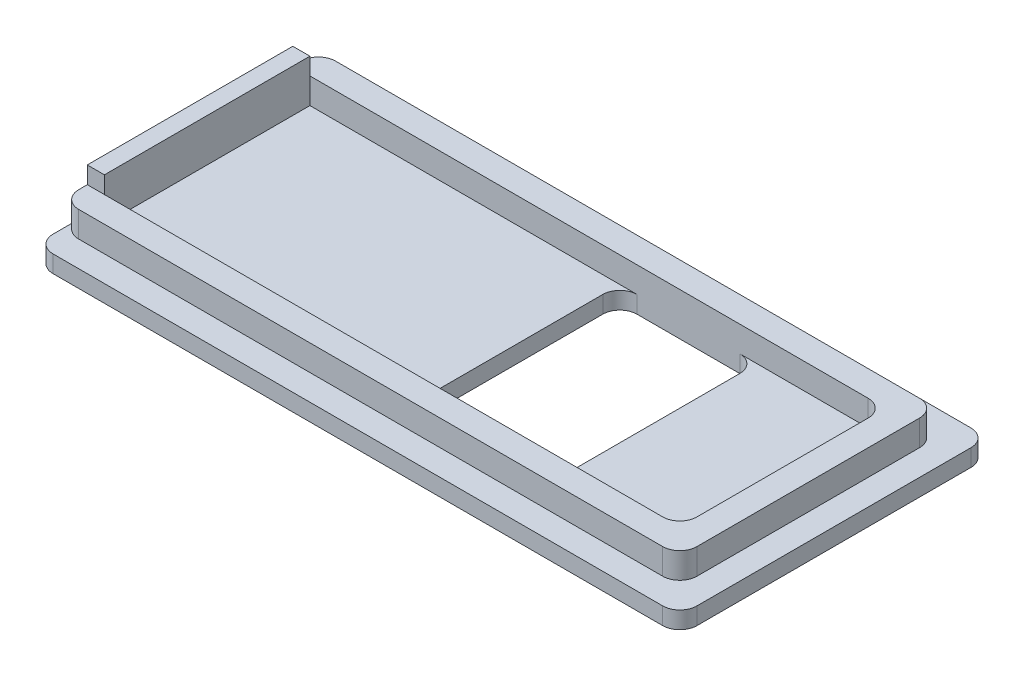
from build123d import *

# Parameters (mm, degrees)
CROQUIS1_W              = 37.6
CROQUIS1_H              = 18
SALIENTE_EXTRUIR1_DEPTH = 1
SALIENTE_EXTRUIR3_DEPTH = 1.5
CROQUIS4_W              = 1
CROQUIS4_H              = 12
SALIENTE_EXTRUIR4_DEPTH = 2.5
CROQUIS5_W              = 8
CROQUIS5_H              = 12
CORTAR_EXTRUIR1_DEPTH   = 42.761345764
REDONDEO9_R             = 1
REDONDEO10_R            = 1
REDONDEO11_R            = 1


with BuildPart() as part:
    # Croquis1 → Saliente-Extruir1 (new body)
    with BuildSketch(Plane(origin=(0, 0, 0), x_dir=(1, 0, 0), z_dir=(0, 1, 0))):
        with Locations((18.8, 9)):
            Rectangle(CROQUIS1_W, CROQUIS1_H)
    extrude(amount=SALIENTE_EXTRUIR1_DEPTH)

    # Croquis3 → Saliente-Extruir3 (add)
    with BuildSketch(Plane(origin=(0, 1, 0), x_dir=(1, 0, 0), z_dir=(0, 1, 0))):
        Polygon((36.1, 16.5), (0, 16.5), (0, 15), (34.6, 15), (34.6, 3), (0, 3), (0, 1.5), (36.1, 1.5), align=None)
    extrude(amount=SALIENTE_EXTRUIR3_DEPTH)

    # Croquis4 → Saliente-Extruir4 (add)
    with BuildSketch(Plane(origin=(0, 1, 0), x_dir=(1, 0, 0), z_dir=(0, 1, 0))):
        with Locations((0.5, 9)):
            Rectangle(CROQUIS4_W, CROQUIS4_H)
    extrude(amount=SALIENTE_EXTRUIR4_DEPTH)

    # Croquis5 → Cortar-Extruir1 (cut, through all)
    with BuildSketch(Plane(origin=(0, 1, 0), x_dir=(1, 0, 0), z_dir=(0, 1, 0))):
        with Locations((23.1, 9)):
            Rectangle(CROQUIS5_W, CROQUIS5_H)
    extrude(amount=-CORTAR_EXTRUIR1_DEPTH, mode=Mode.SUBTRACT)

    # Redondeo9
    redondeo9_edges = [part.edges().sort_by_distance(p)[0] for p in [
        (36.1, 1.75, -1.5),
        (0, 1.75, -1.5),
        (0, 0.5, -18),
        (34.6, 1.75, -15),
        (34.6, 1.75, -3),
        (36.1, 1.75, -16.5),
        (37.6, 0.5, -18),
        (37.6, 0.5, 0),
        (0, 0.5, 0),
    ]]
    fillet(redondeo9_edges, radius=REDONDEO9_R)

    # Redondeo10
    redondeo10_edges = [part.edges().sort_by_distance(p)[0] for p in [
        (0, 1.75, -16.5),
    ]]
    fillet(redondeo10_edges, radius=REDONDEO10_R)

    # Redondeo11
    redondeo11_edges = [part.edges().sort_by_distance(p)[0] for p in [
        (27.1, 0.5, -3),
        (19.1, 0.5, -3),
        (19.1, 0.5, -15),
        (27.1, 0.5, -15),
    ]]
    fillet(redondeo11_edges, radius=REDONDEO11_R)


solid = part.part
